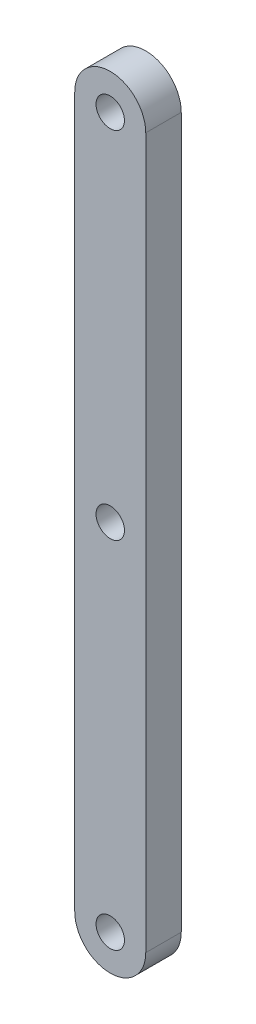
from build123d import *

# Parameters (mm, degrees)
SKETCH2_R           = 2
BOSS_EXTRUDE1_DEPTH = 5


with BuildPart() as part:
    # Sketch2 → Boss-Extrude1 (new body)
    with BuildSketch(Plane.XY):
        with BuildLine():
            Line((-5, 0), (-5, 100))
            ThreePointArc((-5, 100), (0, 105), (5, 100))
            Line((5, 100), (5, 0))
            ThreePointArc((5, 0), (0, -5), (-5, 0))
        make_face()
        with Locations((0, 100)):
            Circle(SKETCH2_R, mode=Mode.SUBTRACT)
        Circle(SKETCH2_R, mode=Mode.SUBTRACT)
        with Locations((0, 50)):
            Circle(SKETCH2_R, mode=Mode.SUBTRACT)
    extrude(amount=BOSS_EXTRUDE1_DEPTH)


solid = part.part
